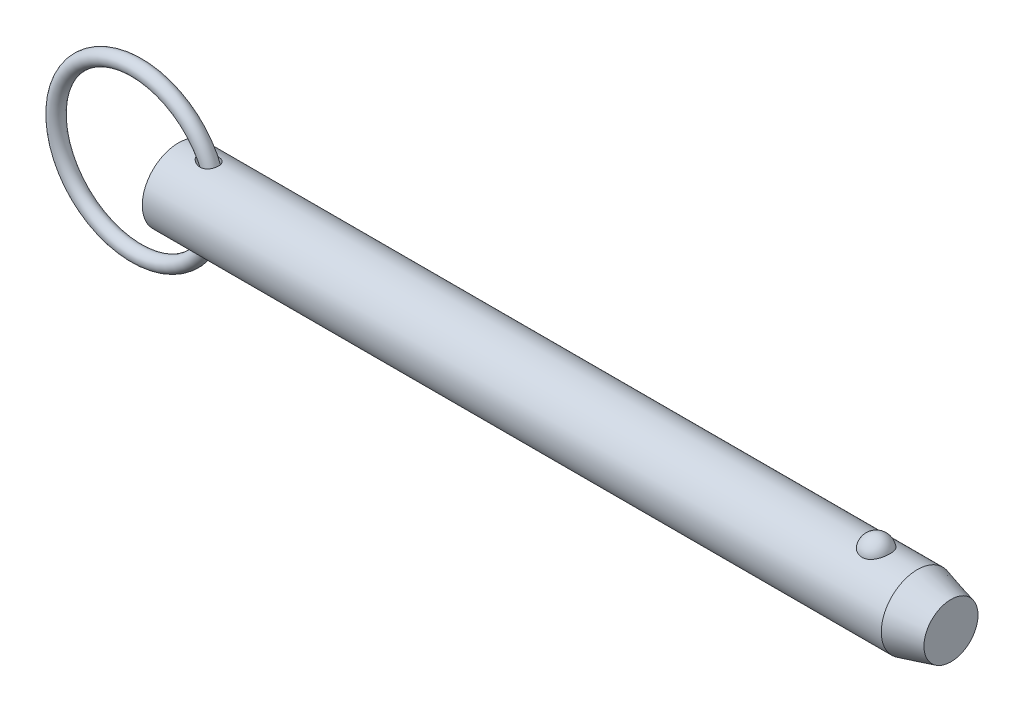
ISO-10303-21;
HEADER;
FILE_DESCRIPTION(('STEP AP214'),'2;1');
FILE_NAME('part.step','',(''),(''),'','','');
FILE_SCHEMA(('AUTOMOTIVE_DESIGN { 1 0 10303 214 1 1 1 1 }'));
ENDSEC;
DATA;
#1=APPLICATION_CONTEXT('core data for automotive mechanical design processes');
#2=APPLICATION_PROTOCOL_DEFINITION('international standard','automotive_design',2000,#1);
#3=PRODUCT_CONTEXT('',#1,'mechanical');
#4=PRODUCT('Part','Part','',(#3));
#5=PRODUCT_RELATED_PRODUCT_CATEGORY('part','',(#4));
#6=PRODUCT_DEFINITION_FORMATION('','',#4);
#7=PRODUCT_DEFINITION_CONTEXT('part definition',#1,'design');
#8=PRODUCT_DEFINITION('design','',#6,#7);
#9=PRODUCT_DEFINITION_SHAPE('','',#8);
#10=(LENGTH_UNIT() NAMED_UNIT(*) SI_UNIT(.MILLI.,.METRE.));
#11=(NAMED_UNIT(*) PLANE_ANGLE_UNIT() SI_UNIT($,.RADIAN.));
#12=(NAMED_UNIT(*) SI_UNIT($,.STERADIAN.) SOLID_ANGLE_UNIT());
#13=UNCERTAINTY_MEASURE_WITH_UNIT(LENGTH_MEASURE(1.E-05),#10,'distance_accuracy_value','');
#14=(GEOMETRIC_REPRESENTATION_CONTEXT(3) GLOBAL_UNCERTAINTY_ASSIGNED_CONTEXT((#13)) GLOBAL_UNIT_ASSIGNED_CONTEXT((#10,
#11,#12)) REPRESENTATION_CONTEXT('',''));
#15=CARTESIAN_POINT('',(0.,0.,0.));
#16=DIRECTION('',(0.,0.,1.));
#17=DIRECTION('',(1.,0.,0.));
#18=AXIS2_PLACEMENT_3D('',#15,#16,#17);
#19=CARTESIAN_POINT('',(-8.23730968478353,0.,0.));
#20=DIRECTION('',(0.,0.,1.));
#21=DIRECTION('',(1.,0.,0.));
#22=AXIS2_PLACEMENT_3D('',#19,#20,#21);
#23=TOROIDAL_SURFACE('',#22,15.875,1.422);
#24=CARTESIAN_POINT('',(9.05969031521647,0.,0.));
#25=VERTEX_POINT('',#24);
#26=VERTEX_LOOP('',#25);
#27=FACE_BOUND('',#26,.T.);
#28=ADVANCED_FACE('P0_F12',(#27),#23,.T.);
#29=CLOSED_SHELL('',(#28));
#30=MANIFOLD_SOLID_BREP('P0_B1',#29);
#31=CARTESIAN_POINT('',(0.,0.,0.));
#32=DIRECTION('',(1.,0.,0.));
#33=DIRECTION('',(0.,0.,-1.));
#34=AXIS2_PLACEMENT_3D('',#31,#32,#33);
#35=CYLINDRICAL_SURFACE('',#34,7.11);
#36=CARTESIAN_POINT('',(3.98467340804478,7.10072679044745,-0.363013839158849));
#37=CARTESIAN_POINT('',(4.00971652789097,7.09600153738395,-0.45539194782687));
#38=CARTESIAN_POINT('',(4.04401947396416,7.08958406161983,-0.545230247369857));
#39=CARTESIAN_POINT('',(4.12810160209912,7.07427055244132,-0.717157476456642));
#40=CARTESIAN_POINT('',(4.17791765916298,7.06536861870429,-0.799227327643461));
#41=CARTESIAN_POINT('',(4.28924471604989,7.04620300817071,-0.953469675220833));
#42=CARTESIAN_POINT('',(4.35063580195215,7.035953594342,-1.02573162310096));
#43=CARTESIAN_POINT('',(4.48282610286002,7.01493313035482,-1.16081412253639));
#44=CARTESIAN_POINT('',(4.55362244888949,7.00416223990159,-1.22363754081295));
#45=CARTESIAN_POINT('',(4.71659336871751,6.98090398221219,-1.35055080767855));
#46=CARTESIAN_POINT('',(4.81029272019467,6.96847103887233,-1.41269256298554));
#47=CARTESIAN_POINT('',(5.0057240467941,6.94515366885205,-1.52319699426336));
#48=CARTESIAN_POINT('',(5.10746392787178,6.93427079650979,-1.57154588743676));
#49=CARTESIAN_POINT('',(5.33503739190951,6.91346066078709,-1.66091325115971));
#50=CARTESIAN_POINT('',(5.46199550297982,6.90402388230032,-1.69921932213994));
#51=CARTESIAN_POINT('',(5.72084799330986,6.89024030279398,-1.75428261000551));
#52=CARTESIAN_POINT('',(5.85274301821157,6.88589416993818,-1.77103699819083));
#53=CARTESIAN_POINT('',(6.11557710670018,6.88337277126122,-1.78081990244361));
#54=CARTESIAN_POINT('',(6.24650031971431,6.88510489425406,-1.77420448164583));
#55=CARTESIAN_POINT('',(6.50446311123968,6.89478744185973,-1.73620392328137));
#56=CARTESIAN_POINT('',(6.6315075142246,6.90272978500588,-1.70485097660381));
#57=CARTESIAN_POINT('',(6.85933269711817,6.92243075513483,-1.62281888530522));
#58=CARTESIAN_POINT('',(6.96133251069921,6.93352131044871,-1.5753580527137));
#59=CARTESIAN_POINT('',(7.15436649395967,6.95824811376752,-1.46226310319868));
#60=CARTESIAN_POINT('',(7.24540699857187,6.97188287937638,-1.3966395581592));
#61=CARTESIAN_POINT('',(7.40446019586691,6.99838217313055,-1.25668991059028));
#62=CARTESIAN_POINT('',(7.473875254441,7.01118308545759,-1.18393777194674));
#63=CARTESIAN_POINT('',(7.59904891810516,7.03582803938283,-1.02736918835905));
#64=CARTESIAN_POINT('',(7.65481029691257,7.04767227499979,-0.943554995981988));
#65=CARTESIAN_POINT('',(7.74982438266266,7.06873077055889,-0.76979592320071));
#66=CARTESIAN_POINT('',(7.7894903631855,7.07800861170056,-0.680084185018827));
#67=CARTESIAN_POINT('',(7.85354088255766,7.09334756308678,-0.495102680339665));
#68=CARTESIAN_POINT('',(7.87792559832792,7.09940871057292,-0.399832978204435));
#69=CARTESIAN_POINT('',(7.9108898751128,7.10766731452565,-0.206294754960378));
#70=CARTESIAN_POINT('',(7.91944662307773,7.10985919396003,-0.108022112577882));
#71=CARTESIAN_POINT('',(7.920501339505,7.11012756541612,0.0886168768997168));
#72=CARTESIAN_POINT('',(7.91299895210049,7.10820396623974,0.186983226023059));
#73=CARTESIAN_POINT('',(7.88205794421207,7.10043733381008,0.381270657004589));
#74=CARTESIAN_POINT('',(7.85857985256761,7.09458459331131,0.477185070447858));
#75=CARTESIAN_POINT('',(7.79617406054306,7.07958431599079,0.663575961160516));
#76=CARTESIAN_POINT('',(7.75724672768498,7.07043685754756,0.754052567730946));
#77=CARTESIAN_POINT('',(7.66496731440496,7.04987259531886,0.926798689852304));
#78=CARTESIAN_POINT('',(7.61164530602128,7.0384605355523,1.00908483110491));
#79=CARTESIAN_POINT('',(7.49191707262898,7.01461776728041,1.16333092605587));
#80=CARTESIAN_POINT('',(7.42551210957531,7.00218715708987,1.235291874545));
#81=CARTESIAN_POINT('',(7.28164031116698,6.97770944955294,1.36680167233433));
#82=CARTESIAN_POINT('',(7.20420170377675,6.96566146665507,1.42638126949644));
#83=CARTESIAN_POINT('',(7.0403906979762,6.94319963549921,1.53199377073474));
#84=CARTESIAN_POINT('',(6.95401827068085,6.93278579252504,1.57802663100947));
#85=CARTESIAN_POINT('',(6.7731858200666,6.91444459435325,1.65656940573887));
#86=CARTESIAN_POINT('',(6.67860569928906,6.90656682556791,1.68881327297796));
#87=CARTESIAN_POINT('',(6.48544119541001,6.89422806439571,1.73849768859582));
#88=CARTESIAN_POINT('',(6.38685561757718,6.88976809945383,1.755933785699));
#89=CARTESIAN_POINT('',(6.18089829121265,6.88429907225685,1.77726234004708));
#90=CARTESIAN_POINT('',(6.07340937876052,6.88356485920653,1.78007646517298));
#91=CARTESIAN_POINT('',(5.85921220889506,6.886086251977,1.77029087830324));
#92=CARTESIAN_POINT('',(5.75250426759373,6.88934339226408,1.75768523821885));
#93=CARTESIAN_POINT('',(5.52848027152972,6.89994454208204,1.71563399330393));
#94=CARTESIAN_POINT('',(5.41155168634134,6.90775772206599,1.68424184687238));
#95=CARTESIAN_POINT('',(5.18376466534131,6.92670168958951,1.60454711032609));
#96=CARTESIAN_POINT('',(5.07291446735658,6.9378368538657,1.5562221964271));
#97=CARTESIAN_POINT('',(4.84835244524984,6.96347168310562,1.43744827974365));
#98=CARTESIAN_POINT('',(4.73562531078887,6.97820486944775,1.36517310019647));
#99=CARTESIAN_POINT('',(4.52504912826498,7.00822340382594,1.20158053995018));
#100=CARTESIAN_POINT('',(4.42717478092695,7.02350775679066,1.11029618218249));
#101=CARTESIAN_POINT('',(4.27935716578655,7.04784659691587,0.940654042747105));
#102=CARTESIAN_POINT('',(4.2239722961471,7.05736064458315,0.867099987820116));
#103=CARTESIAN_POINT('',(4.12558347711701,7.07469854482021,0.711919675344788));
#104=CARTESIAN_POINT('',(4.08256922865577,7.0825238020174,0.630300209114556));
#105=CARTESIAN_POINT('',(4.01142860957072,7.09565978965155,0.459428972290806));
#106=CARTESIAN_POINT('',(3.98346043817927,7.10094374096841,0.370107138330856));
#107=CARTESIAN_POINT('',(3.95517285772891,7.1063173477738,0.233358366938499));
#108=CARTESIAN_POINT('',(3.94802115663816,7.1076831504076,0.187321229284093));
#109=CARTESIAN_POINT('',(3.93842121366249,7.10951900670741,0.0947476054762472));
#110=CARTESIAN_POINT('',(3.93597129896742,7.10998937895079,0.0482113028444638));
#111=CARTESIAN_POINT('',(3.93584361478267,7.11001358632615,-0.0598597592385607));
#112=CARTESIAN_POINT('',(3.9399538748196,7.10922402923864,-0.121405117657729));
#113=CARTESIAN_POINT('',(3.95632793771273,7.10609781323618,-0.243320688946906));
#114=CARTESIAN_POINT('',(3.96859135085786,7.10376122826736,-0.303690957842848));
#115=CARTESIAN_POINT('',(3.98467340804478,7.10072679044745,-0.363013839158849));
#116=B_SPLINE_CURVE_WITH_KNOTS('',3,(#36,#37,#38,#39,#40,#41,#42,#43,#44,#45,#46,#47,#48,#49,
#50,#51,#52,#53,#54,#55,#56,#57,#58,#59,#60,#61,#62,#63,#64,#65,#66,#67,#68,#69,#70,#71,#72,#73,
#74,#75,#76,#77,#78,#79,#80,#81,#82,#83,#84,#85,#86,#87,#88,#89,#90,#91,#92,#93,#94,#95,#96,#97,
#98,#99,#100,#101,#102,#103,#104,#105,#106,#107,#108,#109,#110,#111,#112,#113,#114,#115),
.UNSPECIFIED.,.T.,.F.,(4,2,2,2,2,2,2,2,2,2,2,2,2,2,2,2,2,2,2,2,2,2,2,2,2,2,2,2,2,2,2,2,2,2,2,2,
2,2,2,4),(0.,0.287206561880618,0.575101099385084,0.860162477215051,1.14513709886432,
1.48324846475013,1.82169652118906,2.21865672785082,2.6156690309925,3.00665870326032,
3.39714041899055,3.73437585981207,4.07141541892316,4.37402271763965,4.67656849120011,
4.97076150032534,5.26495110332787,5.55956439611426,5.85418421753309,6.14953461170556,
6.44487798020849,6.73960905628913,7.03431171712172,7.32827352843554,7.6222362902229,
7.9216396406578,8.22113296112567,8.54242840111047,8.86384740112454,9.22635035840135,
9.58933304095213,9.99153142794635,10.3930368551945,10.6697219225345,10.9461759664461,
11.2254825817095,11.3650959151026,11.5046595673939,11.6891051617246,11.8735419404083),.UNSPECIFIED.);
#117=CARTESIAN_POINT('',(3.98467340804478,7.10072679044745,-0.363013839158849));
#118=VERTEX_POINT('',#117);
#119=EDGE_CURVE('P1_E40',#118,#118,#116,.T.);
#120=ORIENTED_EDGE('',*,*,#119,.T.);
#121=EDGE_LOOP('',(#120));
#122=FACE_BOUND('',#121,.T.);
#123=CARTESIAN_POINT('',(145.736279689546,0.,0.));
#124=DIRECTION('',(1.,0.,0.));
#125=DIRECTION('',(0.,0.,-1.));
#126=AXIS2_PLACEMENT_3D('',#123,#124,#125);
#127=CIRCLE('',#126,7.11);
#128=CARTESIAN_POINT('',(145.736279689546,0.,-7.11));
#129=VERTEX_POINT('',#128);
#130=EDGE_CURVE('P1_E25',#129,#129,#127,.T.);
#131=ORIENTED_EDGE('',*,*,#130,.F.);
#132=EDGE_LOOP('',(#131));
#133=FACE_BOUND('',#132,.T.);
#134=CARTESIAN_POINT('',(0.,0.,0.));
#135=DIRECTION('',(1.,0.,0.));
#136=DIRECTION('',(0.,0.,-1.));
#137=AXIS2_PLACEMENT_3D('',#134,#135,#136);
#138=CIRCLE('',#137,7.11);
#139=CARTESIAN_POINT('',(0.,0.,-7.11));
#140=VERTEX_POINT('',#139);
#141=EDGE_CURVE('P1_E9',#140,#140,#138,.T.);
#142=ORIENTED_EDGE('',*,*,#141,.T.);
#143=EDGE_LOOP('',(#142));
#144=FACE_BOUND('',#143,.T.);
#145=CARTESIAN_POINT('',(137.629258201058,6.53646663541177,2.79762469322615));
#146=CARTESIAN_POINT('',(137.484429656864,6.53647876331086,2.79761243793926));
#147=CARTESIAN_POINT('',(137.339368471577,6.54144531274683,2.7860811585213));
#148=CARTESIAN_POINT('',(137.053292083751,6.56077791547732,2.74023282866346));
#149=CARTESIAN_POINT('',(136.91228845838,6.57516852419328,2.70585624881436));
#150=CARTESIAN_POINT('',(136.63888335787,6.61165072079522,2.61544042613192));
#151=CARTESIAN_POINT('',(136.506460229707,6.63372195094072,2.55945840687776));
#152=CARTESIAN_POINT('',(136.253233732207,6.68316012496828,2.4274295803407));
#153=CARTESIAN_POINT('',(136.132425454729,6.71052481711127,2.35139129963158));
#154=CARTESIAN_POINT('',(135.901637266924,6.76860821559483,2.17866150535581));
#155=CARTESIAN_POINT('',(135.792085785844,6.79940242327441,2.08142342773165));
#156=CARTESIAN_POINT('',(135.59033404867,6.86050242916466,1.87020907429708));
#157=CARTESIAN_POINT('',(135.498139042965,6.89080807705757,1.75622775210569));
#158=CARTESIAN_POINT('',(135.32925478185,6.94923069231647,1.50900646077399));
#159=CARTESIAN_POINT('',(135.253428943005,6.97719213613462,1.37513873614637));
#160=CARTESIAN_POINT('',(135.124206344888,7.02647251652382,1.09584817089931));
#161=CARTESIAN_POINT('',(135.070810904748,7.04779106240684,0.950424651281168));
#162=CARTESIAN_POINT('',(134.987101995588,7.08180248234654,0.650508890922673));
#163=CARTESIAN_POINT('',(134.957025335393,7.09440672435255,0.495940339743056));
#164=CARTESIAN_POINT('',(134.921473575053,7.10935121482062,0.183515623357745));
#165=CARTESIAN_POINT('',(134.915997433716,7.11169189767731,0.0256595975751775));
#166=CARTESIAN_POINT('',(134.929700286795,7.10589702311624,-0.287512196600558));
#167=CARTESIAN_POINT('',(134.94868231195,7.0978451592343,-0.442838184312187));
#168=CARTESIAN_POINT('',(135.01057450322,7.07221860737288,-0.747830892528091));
#169=CARTESIAN_POINT('',(135.053485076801,7.05464375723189,-0.897497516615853));
#170=CARTESIAN_POINT('',(135.162452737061,7.01171031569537,-1.18722864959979));
#171=CARTESIAN_POINT('',(135.228545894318,6.98633960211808,-1.32727778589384));
#172=CARTESIAN_POINT('',(135.382536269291,6.93042258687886,-1.59370324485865));
#173=CARTESIAN_POINT('',(135.470435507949,6.89987580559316,-1.72007829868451));
#174=CARTESIAN_POINT('',(135.666926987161,6.83659510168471,-1.95657345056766));
#175=CARTESIAN_POINT('',(135.775664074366,6.80384697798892,-2.06656957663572));
#176=CARTESIAN_POINT('',(136.010968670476,6.74001831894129,-2.26611005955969));
#177=CARTESIAN_POINT('',(136.137535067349,6.7089376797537,-2.35565569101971));
#178=CARTESIAN_POINT('',(136.402845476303,6.65264442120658,-2.51019726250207));
#179=CARTESIAN_POINT('',(136.541323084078,6.62733449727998,-2.57561395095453));
#180=CARTESIAN_POINT('',(136.828519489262,6.58495995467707,-2.68211134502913));
#181=CARTESIAN_POINT('',(136.977234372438,6.56789220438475,-2.72320129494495));
#182=CARTESIAN_POINT('',(137.272626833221,6.54478663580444,-2.77825810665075));
#183=CARTESIAN_POINT('',(137.419029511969,6.53823639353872,-2.79348727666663));
#184=CARTESIAN_POINT('',(137.712470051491,6.53532718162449,-2.80028921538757));
#185=CARTESIAN_POINT('',(137.859507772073,6.538966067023,-2.79186696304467));
#186=CARTESIAN_POINT('',(138.144921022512,6.55570357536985,-2.75232178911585));
#187=CARTESIAN_POINT('',(138.283422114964,6.56848455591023,-2.72196077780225));
#188=CARTESIAN_POINT('',(138.553114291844,6.60173528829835,-2.6402877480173));
#189=CARTESIAN_POINT('',(138.684304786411,6.6222056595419,-2.58897404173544));
#190=CARTESIAN_POINT('',(138.938846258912,6.66917927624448,-2.46547820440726));
#191=CARTESIAN_POINT('',(139.061969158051,6.69580233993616,-2.39287266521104));
#192=CARTESIAN_POINT('',(139.294441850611,6.75207041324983,-2.22915269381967));
#193=CARTESIAN_POINT('',(139.403788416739,6.78171612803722,-2.13803393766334));
#194=CARTESIAN_POINT('',(139.611642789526,6.8426462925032,-1.93445592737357));
#195=CARTESIAN_POINT('',(139.709317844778,6.8739374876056,-1.82114774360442));
#196=CARTESIAN_POINT('',(139.885011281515,6.93345710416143,-1.57947787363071));
#197=CARTESIAN_POINT('',(139.963026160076,6.96168497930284,-1.45111351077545));
#198=CARTESIAN_POINT('',(140.099985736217,7.0130755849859,-1.17842708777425));
#199=CARTESIAN_POINT('',(140.158258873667,7.03605262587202,-1.03373189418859));
#200=CARTESIAN_POINT('',(140.251081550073,7.07340932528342,-0.735867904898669));
#201=CARTESIAN_POINT('',(140.285631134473,7.08778900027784,-0.582699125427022));
#202=CARTESIAN_POINT('',(140.330274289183,7.10647639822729,-0.272420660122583));
#203=CARTESIAN_POINT('',(140.34039710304,7.11079616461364,-0.115315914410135));
#204=CARTESIAN_POINT('',(140.336061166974,7.10896059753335,0.198488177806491));
#205=CARTESIAN_POINT('',(140.321603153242,7.10280557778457,0.35518753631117));
#206=CARTESIAN_POINT('',(140.268572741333,7.08071500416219,0.662724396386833));
#207=CARTESIAN_POINT('',(140.23015058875,7.06484039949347,0.81359224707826));
#208=CARTESIAN_POINT('',(140.130101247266,7.02495896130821,1.10629159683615));
#209=CARTESIAN_POINT('',(140.068472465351,7.00095156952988,1.24812247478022));
#210=CARTESIAN_POINT('',(139.922766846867,6.94706632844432,1.51976439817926));
#211=CARTESIAN_POINT('',(139.838544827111,6.91715085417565,1.64949012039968));
#212=CARTESIAN_POINT('',(139.649586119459,6.8547056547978,1.89231285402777));
#213=CARTESIAN_POINT('',(139.544850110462,6.82217601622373,2.0054104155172));
#214=CARTESIAN_POINT('',(139.317103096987,6.75805358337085,2.21190674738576));
#215=CARTESIAN_POINT('',(139.194082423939,6.72646129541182,2.30529503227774));
#216=CARTESIAN_POINT('',(138.93273470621,6.66789520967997,2.46959908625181));
#217=CARTESIAN_POINT('',(138.794401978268,6.64092313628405,2.54050647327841));
#218=CARTESIAN_POINT('',(138.511182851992,6.59572583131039,2.6556004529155));
#219=CARTESIAN_POINT('',(138.366666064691,6.57724013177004,2.70059539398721));
#220=CARTESIAN_POINT('',(138.071546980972,6.55006426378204,2.76587321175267));
#221=CARTESIAN_POINT('',(137.920964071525,6.54134511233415,2.78622922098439));
#222=CARTESIAN_POINT('',(137.723046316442,6.53697847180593,2.79642434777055));
#223=CARTESIAN_POINT('',(137.676164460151,6.53646270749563,2.79762866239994));
#224=CARTESIAN_POINT('',(137.629258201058,6.53646663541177,2.79762469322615));
#225=B_SPLINE_CURVE_WITH_KNOTS('',3,(#145,#146,#147,#148,#149,#150,#151,#152,#153,#154,#155,
#156,#157,#158,#159,#160,#161,#162,#163,#164,#165,#166,#167,#168,#169,#170,#171,#172,#173,#174,
#175,#176,#177,#178,#179,#180,#181,#182,#183,#184,#185,#186,#187,#188,#189,#190,#191,#192,#193,
#194,#195,#196,#197,#198,#199,#200,#201,#202,#203,#204,#205,#206,#207,#208,#209,#210,#211,#212,
#213,#214,#215,#216,#217,#218,#219,#220,#221,#222,#223,#224),.UNSPECIFIED.,.T.,.F.,(4,2,2,2,2,2,
2,2,2,2,2,2,2,2,2,2,2,2,2,2,2,2,2,2,2,2,2,2,2,2,2,2,2,2,2,2,2,2,2,4),(0.,0.43435572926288,
0.869847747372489,1.30419416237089,1.738356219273,2.18541922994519,2.63261726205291,
3.09954261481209,3.56649542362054,4.03813031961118,4.50974525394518,4.9775857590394,
5.44543423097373,5.9140138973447,6.38263700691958,6.85464418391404,7.32662193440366,
7.78992971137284,8.25306131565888,8.69285754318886,9.13256119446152,9.55768625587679,
9.98284556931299,10.417110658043,10.8514772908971,11.3079089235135,11.7644218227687,
12.2351898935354,12.7059570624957,13.1761603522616,13.6463495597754,14.1136200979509,
14.5809227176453,15.0513032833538,15.5216682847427,15.9922828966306,16.4630727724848,
16.9182457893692,17.3720644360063,17.5127411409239),.UNSPECIFIED.);
#226=CARTESIAN_POINT('',(137.629258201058,6.53646663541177,2.79762469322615));
#227=VERTEX_POINT('',#226);
#228=EDGE_CURVE('P1_E34',#227,#227,#225,.T.);
#229=ORIENTED_EDGE('',*,*,#228,.T.);
#230=EDGE_LOOP('',(#229));
#231=FACE_BOUND('',#230,.T.);
#232=CARTESIAN_POINT('',(3.98467340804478,-7.10072679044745,-0.363013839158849));
#233=CARTESIAN_POINT('',(3.96426456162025,-7.10457733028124,-0.287714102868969));
#234=CARTESIAN_POINT('',(3.95000501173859,-7.10730349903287,-0.210695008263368));
#235=CARTESIAN_POINT('',(3.93481801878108,-7.11020840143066,-0.0553038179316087));
#236=CARTESIAN_POINT('',(3.93388435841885,-7.11038832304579,0.0230676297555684));
#237=CARTESIAN_POINT('',(3.94541910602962,-7.10817995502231,0.178714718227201));
#238=CARTESIAN_POINT('',(3.95787987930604,-7.10579312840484,0.25599095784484));
#239=CARTESIAN_POINT('',(3.99523775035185,-7.09872642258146,0.407352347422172));
#240=CARTESIAN_POINT('',(4.02014065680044,-7.09404547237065,0.481435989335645));
#241=CARTESIAN_POINT('',(4.08119600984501,-7.08278363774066,0.625775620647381));
#242=CARTESIAN_POINT('',(4.11749458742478,-7.07617815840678,0.695967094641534));
#243=CARTESIAN_POINT('',(4.19940836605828,-7.06165305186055,0.830508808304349));
#244=CARTESIAN_POINT('',(4.24502952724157,-7.0537325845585,0.894855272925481));
#245=CARTESIAN_POINT('',(4.36790232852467,-7.03310314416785,1.04688574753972));
#246=CARTESIAN_POINT('',(4.44977459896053,-7.01993229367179,1.13078695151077));
#247=CARTESIAN_POINT('',(4.62610796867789,-6.99351259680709,1.28411726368));
#248=CARTESIAN_POINT('',(4.7205898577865,-6.98026365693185,1.35352197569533));
#249=CARTESIAN_POINT('',(4.92036507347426,-6.9549104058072,1.47831921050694));
#250=CARTESIAN_POINT('',(5.02579054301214,-6.94282458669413,1.53350332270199));
#251=CARTESIAN_POINT('',(5.24378330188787,-6.92129098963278,1.62793610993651));
#252=CARTESIAN_POINT('',(5.35635066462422,-6.91184323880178,1.66718462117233));
#253=CARTESIAN_POINT('',(5.60134354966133,-6.89573491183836,1.73269893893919));
#254=CARTESIAN_POINT('',(5.73444697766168,-6.8895970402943,1.75661057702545));
#255=CARTESIAN_POINT('',(6.00300738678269,-6.88344616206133,1.78057487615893));
#256=CARTESIAN_POINT('',(6.13846360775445,-6.88343121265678,1.78063510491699));
#257=CARTESIAN_POINT('',(6.39660470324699,-6.88981379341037,1.75576480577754));
#258=CARTESIAN_POINT('',(6.51947843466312,-6.89572457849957,1.73273121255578));
#259=CARTESIAN_POINT('',(6.75813770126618,-6.91274434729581,1.66352936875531));
#260=CARTESIAN_POINT('',(6.87393155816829,-6.92384709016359,1.61738888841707));
#261=CARTESIAN_POINT('',(7.07801861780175,-6.94787316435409,1.51052664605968));
#262=CARTESIAN_POINT('',(7.16789841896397,-6.96033024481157,1.45271574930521));
#263=CARTESIAN_POINT('',(7.33546773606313,-6.98638661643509,1.32171912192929));
#264=CARTESIAN_POINT('',(7.41316182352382,-6.99998547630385,1.24853918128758));
#265=CARTESIAN_POINT('',(7.54861420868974,-7.02559503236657,1.09486170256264));
#266=CARTESIAN_POINT('',(7.60741145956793,-7.03764930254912,1.01528346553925));
#267=CARTESIAN_POINT('',(7.71070740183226,-7.0598657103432,0.847099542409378));
#268=CARTESIAN_POINT('',(7.75520788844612,-7.0700280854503,0.758494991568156));
#269=CARTESIAN_POINT('',(7.82836147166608,-7.08722075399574,0.575936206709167));
#270=CARTESIAN_POINT('',(7.85719783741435,-7.09428707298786,0.482058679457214));
#271=CARTESIAN_POINT('',(7.89918378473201,-7.10470260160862,0.29065874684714));
#272=CARTESIAN_POINT('',(7.91233308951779,-7.10805174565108,0.193136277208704));
#273=CARTESIAN_POINT('',(7.92267451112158,-7.11067890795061,-0.00313968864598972));
#274=CARTESIAN_POINT('',(7.91981203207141,-7.10994299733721,-0.10189624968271));
#275=CARTESIAN_POINT('',(7.89806489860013,-7.10444651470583,-0.297516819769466));
#276=CARTESIAN_POINT('',(7.87918005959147,-7.09968589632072,-0.394380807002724));
#277=CARTESIAN_POINT('',(7.82577988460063,-7.0866471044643,-0.58355375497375));
#278=CARTESIAN_POINT('',(7.79124976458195,-7.07836560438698,-0.675858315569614));
#279=CARTESIAN_POINT('',(7.70736343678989,-7.05919003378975,-0.853167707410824));
#280=CARTESIAN_POINT('',(7.65800801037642,-7.04829610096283,-0.938172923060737));
#281=CARTESIAN_POINT('',(7.54590141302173,-7.02513961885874,-1.09819812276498));
#282=CARTESIAN_POINT('',(7.48319521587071,-7.01288172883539,-1.17325029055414));
#283=CARTESIAN_POINT('',(7.34599775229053,-6.98832192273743,-1.31164333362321));
#284=CARTESIAN_POINT('',(7.27150757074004,-6.97602001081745,-1.37498528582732));
#285=CARTESIAN_POINT('',(7.11277776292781,-6.95268608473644,-1.48849974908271));
#286=CARTESIAN_POINT('',(7.02852525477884,-6.94165578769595,-1.53865456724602));
#287=CARTESIAN_POINT('',(6.85282430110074,-6.92200320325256,-1.62478650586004));
#288=CARTESIAN_POINT('',(6.76137511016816,-6.91338116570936,-1.66076215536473));
#289=CARTESIAN_POINT('',(6.57061179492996,-6.89906044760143,-1.71930563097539));
#290=CARTESIAN_POINT('',(6.47113516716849,-6.89347290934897,-1.74136795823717));
#291=CARTESIAN_POINT('',(6.26989833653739,-6.88605020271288,-1.7704895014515));
#292=CARTESIAN_POINT('',(6.16813737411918,-6.88421630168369,-1.77754365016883));
#293=CARTESIAN_POINT('',(5.95492537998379,-6.88424071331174,-1.77745174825));
#294=CARTESIAN_POINT('',(5.8434768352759,-6.88646827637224,-1.76888555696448));
#295=CARTESIAN_POINT('',(5.62307560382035,-6.89483827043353,-1.73596677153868));
#296=CARTESIAN_POINT('',(5.51412477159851,-6.90098351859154,-1.71160281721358));
#297=CARTESIAN_POINT('',(5.28644478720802,-6.91743803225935,-1.64393691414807));
#298=CARTESIAN_POINT('',(5.16837217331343,-6.92819628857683,-1.59852806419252));
#299=CARTESIAN_POINT('',(4.94091825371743,-6.95234836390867,-1.4899796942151));
#300=CARTESIAN_POINT('',(4.83153887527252,-6.96574276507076,-1.42683625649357));
#301=CARTESIAN_POINT('',(4.63576710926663,-6.99209234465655,-1.29112257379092));
#302=CARTESIAN_POINT('',(4.54816728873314,-7.00494184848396,-1.22027748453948));
#303=CARTESIAN_POINT('',(4.38554897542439,-7.03019055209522,-1.0652111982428));
#304=CARTESIAN_POINT('',(4.31052141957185,-7.04259007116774,-0.980999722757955));
#305=CARTESIAN_POINT('',(4.18551811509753,-7.0640229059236,-0.811206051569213));
#306=CARTESIAN_POINT('',(4.13358417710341,-7.07328321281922,-0.727107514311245));
#307=CARTESIAN_POINT('',(4.04607461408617,-7.0891994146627,-0.550580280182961));
#308=CARTESIAN_POINT('',(4.01046401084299,-7.09586087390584,-0.458169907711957));
#309=CARTESIAN_POINT('',(3.98467340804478,-7.10072679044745,-0.363013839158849));
#310=B_SPLINE_CURVE_WITH_KNOTS('',3,(#232,#233,#234,#235,#236,#237,#238,#239,#240,#241,#242,
#243,#244,#245,#246,#247,#248,#249,#250,#251,#252,#253,#254,#255,#256,#257,#258,#259,#260,#261,
#262,#263,#264,#265,#266,#267,#268,#269,#270,#271,#272,#273,#274,#275,#276,#277,#278,#279,#280,
#281,#282,#283,#284,#285,#286,#287,#288,#289,#290,#291,#292,#293,#294,#295,#296,#297,#298,#299,
#300,#301,#302,#303,#304,#305,#306,#307,#308,#309),.UNSPECIFIED.,.T.,.F.,(4,2,2,2,2,2,2,2,2,2,2,
2,2,2,2,2,2,2,2,2,2,2,2,2,2,2,2,2,2,2,2,2,2,2,2,2,2,2,4),(0.,0.23402065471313,0.467932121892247,
0.701710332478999,0.935597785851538,1.17261620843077,1.40978663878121,1.76177576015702,
2.11435255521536,2.47183528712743,2.8293216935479,3.23332937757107,3.63720887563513,
4.01042610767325,4.38319587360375,4.70425151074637,5.02518641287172,5.32277979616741,
5.62033579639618,5.91433101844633,6.2083314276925,6.50333490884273,6.79834178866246,
7.09362801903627,7.38889868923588,7.6831900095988,7.9774542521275,8.27211131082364,
8.56679892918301,8.8716552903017,9.17661456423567,9.51069129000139,9.84500851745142,
10.2243046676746,10.6036846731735,10.9425776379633,11.2812252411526,11.5775945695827,
11.8733258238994),.UNSPECIFIED.);
#311=CARTESIAN_POINT('',(3.98467340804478,-7.10072679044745,-0.363013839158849));
#312=VERTEX_POINT('',#311);
#313=EDGE_CURVE('P1_E17',#312,#312,#310,.T.);
#314=ORIENTED_EDGE('',*,*,#313,.T.);
#315=EDGE_LOOP('',(#314));
#316=FACE_BOUND('',#315,.T.);
#317=ADVANCED_FACE('P1_F13',(#122,#133,#144,#231,#316),#35,.T.);
#318=CARTESIAN_POINT('',(0.,0.,0.));
#319=DIRECTION('',(-1.,0.,0.));
#320=DIRECTION('',(0.,0.,1.));
#321=AXIS2_PLACEMENT_3D('',#318,#319,#320);
#322=PLANE('',#321);
#323=ORIENTED_EDGE('',*,*,#141,.F.);
#324=EDGE_LOOP('',(#323));
#325=FACE_BOUND('',#324,.T.);
#326=ADVANCED_FACE('P1_F15',(#325),#322,.T.);
#327=CARTESIAN_POINT('',(152.37,0.,0.));
#328=DIRECTION('',(-1.,0.,0.));
#329=DIRECTION('',(0.,0.,1.));
#330=AXIS2_PLACEMENT_3D('',#327,#328,#329);
#331=CONICAL_SURFACE('',#330,5.33250000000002,0.26179938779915);
#332=ORIENTED_EDGE('',*,*,#130,.T.);
#333=EDGE_LOOP('',(#332));
#334=FACE_BOUND('',#333,.T.);
#335=CARTESIAN_POINT('',(152.37,0.,0.));
#336=DIRECTION('',(1.,0.,0.));
#337=DIRECTION('',(0.,0.,-1.));
#338=AXIS2_PLACEMENT_3D('',#335,#336,#337);
#339=CIRCLE('',#338,5.33250000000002);
#340=CARTESIAN_POINT('',(152.37,0.,-5.33250000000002));
#341=VERTEX_POINT('',#340);
#342=EDGE_CURVE('P1_E30',#341,#341,#339,.T.);
#343=ORIENTED_EDGE('',*,*,#342,.F.);
#344=EDGE_LOOP('',(#343));
#345=FACE_BOUND('',#344,.T.);
#346=ADVANCED_FACE('P1_F55',(#334,#345),#331,.T.);
#347=CARTESIAN_POINT('',(152.37,5.33250000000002,0.));
#348=DIRECTION('',(1.,0.,0.));
#349=DIRECTION('',(0.,0.,-1.));
#350=AXIS2_PLACEMENT_3D('',#347,#348,#349);
#351=PLANE('',#350);
#352=ORIENTED_EDGE('',*,*,#342,.T.);
#353=EDGE_LOOP('',(#352));
#354=FACE_BOUND('',#353,.T.);
#355=ADVANCED_FACE('P1_F51',(#354),#351,.T.);
#356=CARTESIAN_POINT('',(137.629258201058,6.399,0.));
#357=DIRECTION('',(-1.,0.,0.));
#358=DIRECTION('',(0.,-1.,0.));
#359=AXIS2_PLACEMENT_3D('',#356,#357,#358);
#360=SPHERICAL_SURFACE('',#359,2.80100000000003);
#361=ORIENTED_EDGE('',*,*,#228,.F.);
#362=EDGE_LOOP('',(#361));
#363=FACE_BOUND('',#362,.T.);
#364=ADVANCED_FACE('P1_F46',(#363),#360,.T.);
#365=CARTESIAN_POINT('',(-8.23730968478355,0.,0.));
#366=DIRECTION('',(0.,0.,1.));
#367=DIRECTION('',(1.,0.,0.));
#368=AXIS2_PLACEMENT_3D('',#365,#366,#367);
#369=TOROIDAL_SURFACE('',#368,15.875,1.7775);
#370=ORIENTED_EDGE('',*,*,#313,.F.);
#371=EDGE_LOOP('',(#370));
#372=FACE_BOUND('',#371,.T.);
#373=ORIENTED_EDGE('',*,*,#119,.F.);
#374=EDGE_LOOP('',(#373));
#375=FACE_BOUND('',#374,.T.);
#376=ADVANCED_FACE('P1_F50',(#372,#375),#369,.F.);
#377=CLOSED_SHELL('',(#317,#326,#346,#355,#364,#376));
#378=MANIFOLD_SOLID_BREP('P1_B1',#377);
#379=ADVANCED_BREP_SHAPE_REPRESENTATION('',(#18,#30,#378),#14);
#380=SHAPE_DEFINITION_REPRESENTATION(#9,#379);
ENDSEC;
END-ISO-10303-21;
